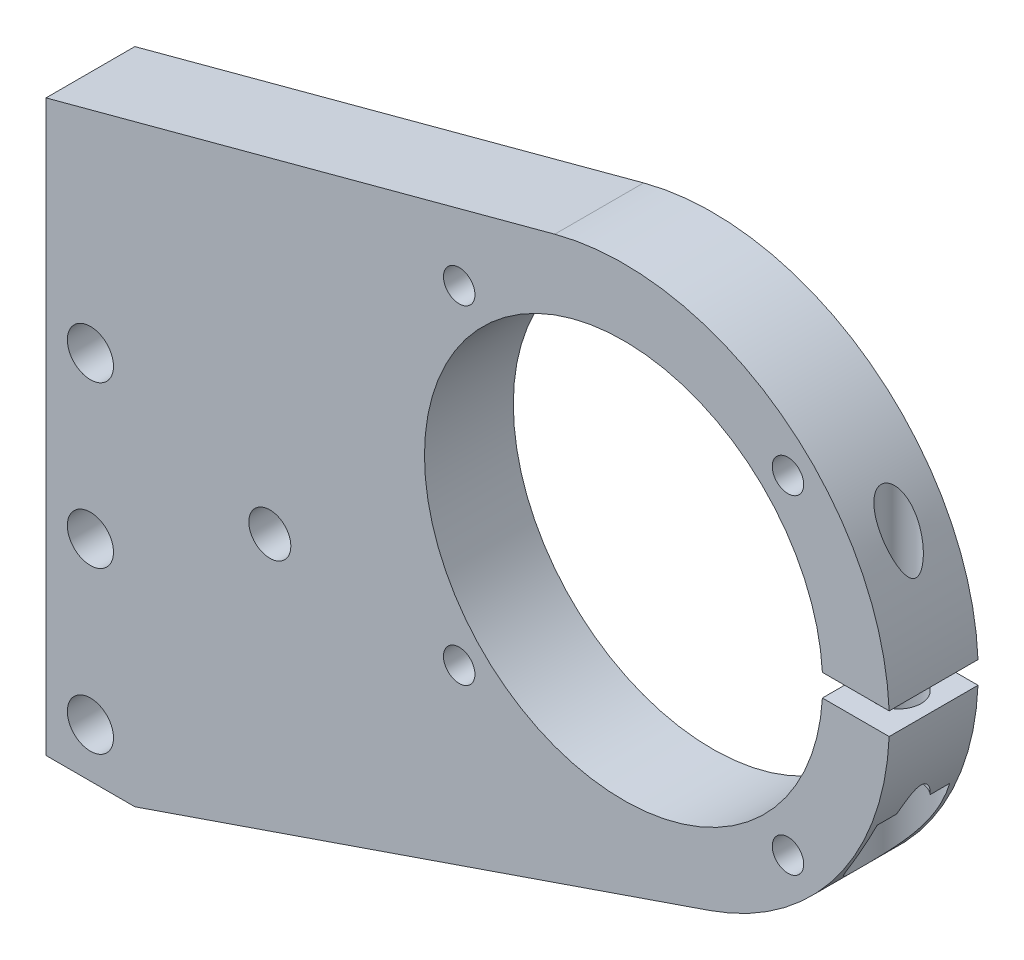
ISO-10303-21;
HEADER;
FILE_DESCRIPTION(('STEP AP214'),'2;1');
FILE_NAME('part.step','',(''),(''),'','','');
FILE_SCHEMA(('AUTOMOTIVE_DESIGN { 1 0 10303 214 1 1 1 1 }'));
ENDSEC;
DATA;
#1=APPLICATION_CONTEXT('core data for automotive mechanical design processes');
#2=APPLICATION_PROTOCOL_DEFINITION('international standard','automotive_design',2000,#1);
#3=PRODUCT_CONTEXT('',#1,'mechanical');
#4=PRODUCT('Part','Part','',(#3));
#5=PRODUCT_RELATED_PRODUCT_CATEGORY('part','',(#4));
#6=PRODUCT_DEFINITION_FORMATION('','',#4);
#7=PRODUCT_DEFINITION_CONTEXT('part definition',#1,'design');
#8=PRODUCT_DEFINITION('design','',#6,#7);
#9=PRODUCT_DEFINITION_SHAPE('','',#8);
#10=(LENGTH_UNIT() NAMED_UNIT(*) SI_UNIT(.MILLI.,.METRE.));
#11=(NAMED_UNIT(*) PLANE_ANGLE_UNIT() SI_UNIT($,.RADIAN.));
#12=(NAMED_UNIT(*) SI_UNIT($,.STERADIAN.) SOLID_ANGLE_UNIT());
#13=UNCERTAINTY_MEASURE_WITH_UNIT(LENGTH_MEASURE(1.E-05),#10,'distance_accuracy_value','');
#14=(GEOMETRIC_REPRESENTATION_CONTEXT(3) GLOBAL_UNCERTAINTY_ASSIGNED_CONTEXT((#13)) GLOBAL_UNIT_ASSIGNED_CONTEXT((#10,
#11,#12)) REPRESENTATION_CONTEXT('',''));
#15=CARTESIAN_POINT('',(0.,0.,0.));
#16=DIRECTION('',(0.,0.,1.));
#17=DIRECTION('',(1.,0.,0.));
#18=AXIS2_PLACEMENT_3D('',#15,#16,#17);
#19=CARTESIAN_POINT('',(-141.600117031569,110.506438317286,12.7));
#20=DIRECTION('',(0.,0.,-1.));
#21=DIRECTION('',(-1.,0.,0.));
#22=AXIS2_PLACEMENT_3D('',#19,#20,#21);
#23=CYLINDRICAL_SURFACE('',#22,38.);
#24=CARTESIAN_POINT('',(-106.511588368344,95.9189383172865,3.95450924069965));
#25=CARTESIAN_POINT('',(-106.453379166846,96.0589408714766,4.00612598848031));
#26=CARTESIAN_POINT('',(-106.396344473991,96.1985077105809,4.0603752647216));
#27=CARTESIAN_POINT('',(-106.284672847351,96.4764072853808,4.17503198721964));
#28=CARTESIAN_POINT('',(-106.230040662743,96.6147371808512,4.23545090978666));
#29=CARTESIAN_POINT('',(-106.123382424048,96.8894249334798,4.36322486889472));
#30=CARTESIAN_POINT('',(-106.071359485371,97.0257803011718,4.43058791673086));
#31=CARTESIAN_POINT('',(-105.970300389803,97.2952001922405,4.5734441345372));
#32=CARTESIAN_POINT('',(-105.921261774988,97.4282673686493,4.648930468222));
#33=CARTESIAN_POINT('',(-105.834418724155,97.6678910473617,4.79681156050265));
#34=CARTESIAN_POINT('',(-105.796094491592,97.7752033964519,4.86766676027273));
#35=CARTESIAN_POINT('',(-105.722207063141,97.9849396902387,5.01857034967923));
#36=CARTESIAN_POINT('',(-105.68665386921,98.0873454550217,5.0986496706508));
#37=CARTESIAN_POINT('',(-105.636021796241,98.2350638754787,5.22815154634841));
#38=CARTESIAN_POINT('',(-105.619486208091,98.2836459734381,5.27323807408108));
#39=CARTESIAN_POINT('',(-105.587651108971,98.3777621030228,5.36687869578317));
#40=CARTESIAN_POINT('',(-105.572352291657,98.4232944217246,5.41543470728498));
#41=CARTESIAN_POINT('',(-105.528905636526,98.5533696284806,5.56657532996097));
#42=CARTESIAN_POINT('',(-105.502923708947,98.6322231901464,5.67531863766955));
#43=CARTESIAN_POINT('',(-105.472632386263,98.7248491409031,5.84683967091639));
#44=CARTESIAN_POINT('',(-105.46423004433,98.7506652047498,5.90235495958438));
#45=CARTESIAN_POINT('',(-105.450154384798,98.7940214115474,6.0168926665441));
#46=CARTESIAN_POINT('',(-105.444478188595,98.8115702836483,6.07591131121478));
#47=CARTESIAN_POINT('',(-105.436377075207,98.83664392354,6.19690920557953));
#48=CARTESIAN_POINT('',(-105.433983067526,98.8440733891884,6.25891098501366));
#49=CARTESIAN_POINT('',(-105.432860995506,98.8475534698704,6.38327478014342));
#50=CARTESIAN_POINT('',(-105.434132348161,98.8436058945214,6.44563673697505));
#51=CARTESIAN_POINT('',(-105.439865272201,98.8258449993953,6.5624005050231));
#52=CARTESIAN_POINT('',(-105.443999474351,98.8130442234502,6.6169803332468));
#53=CARTESIAN_POINT('',(-105.454715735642,98.7799611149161,6.72353567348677));
#54=CARTESIAN_POINT('',(-105.461299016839,98.7596750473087,6.77550987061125));
#55=CARTESIAN_POINT('',(-105.481380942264,98.6980300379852,6.90904632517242));
#56=CARTESIAN_POINT('',(-105.49659636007,98.6515341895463,6.98795664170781));
#57=CARTESIAN_POINT('',(-105.530774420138,98.5479469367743,7.13760712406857));
#58=CARTESIAN_POINT('',(-105.54975012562,98.4908186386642,7.20831740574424));
#59=CARTESIAN_POINT('',(-105.590296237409,98.3698459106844,7.34250668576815));
#60=CARTESIAN_POINT('',(-105.611861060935,98.3060159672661,7.40600068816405));
#61=CARTESIAN_POINT('',(-105.656991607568,98.1736918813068,7.52721039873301));
#62=CARTESIAN_POINT('',(-105.680559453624,98.1051928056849,7.58491983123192));
#63=CARTESIAN_POINT('',(-105.729401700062,97.9646143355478,7.69577415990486));
#64=CARTESIAN_POINT('',(-105.754684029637,97.8925187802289,7.74889484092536));
#65=CARTESIAN_POINT('',(-105.806602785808,97.7459369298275,7.85103555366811));
#66=CARTESIAN_POINT('',(-105.833239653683,97.6714498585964,7.90005423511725));
#67=CARTESIAN_POINT('',(-105.909210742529,97.4611422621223,8.03194914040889));
#68=CARTESIAN_POINT('',(-105.959846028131,97.3233724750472,8.11096728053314));
#69=CARTESIAN_POINT('',(-106.064345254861,97.0442243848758,8.26018101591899));
#70=CARTESIAN_POINT('',(-106.118212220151,96.9028427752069,8.33036815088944));
#71=CARTESIAN_POINT('',(-106.227311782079,96.6216712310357,8.46147556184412));
#72=CARTESIAN_POINT('',(-106.282465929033,96.4819446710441,8.52259779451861));
#73=CARTESIAN_POINT('',(-106.367051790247,96.2713820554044,8.60959836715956));
#74=CARTESIAN_POINT('',(-106.395526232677,96.2011044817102,8.63779174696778));
#75=CARTESIAN_POINT('',(-106.453094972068,96.0602405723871,8.69271732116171));
#76=CARTESIAN_POINT('',(-106.482189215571,95.9896542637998,8.71944964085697));
#77=CARTESIAN_POINT('',(-106.511588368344,95.9189383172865,8.74549075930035));
#78=B_SPLINE_CURVE_WITH_KNOTS('',3,(#24,#25,#26,#27,#28,#29,#30,#31,#32,#33,#34,#35,#36,#37,#38,
#39,#40,#41,#42,#43,#44,#45,#46,#47,#48,#49,#50,#51,#52,#53,#54,#55,#56,#57,#58,#59,#60,#61,#62,
#63,#64,#65,#66,#67,#68,#69,#70,#71,#72,#73,#74,#75,#76,#77),.UNSPECIFIED.,.F.,.F.,(4,2,2,2,2,2,
2,2,2,2,2,2,2,2,2,2,2,2,2,2,2,2,2,2,2,2,4),(0.,0.48053417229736,0.961979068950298,
1.44398575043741,1.92558991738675,2.32784972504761,2.73150001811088,2.93626263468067,
3.14113930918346,3.5475692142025,3.7324153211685,3.9170658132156,4.10344354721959,
4.28979163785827,4.45774124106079,4.62577476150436,4.90269769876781,5.18060008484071,
5.45791365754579,5.73552490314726,6.01452149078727,6.29360955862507,6.79326029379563,
7.29338611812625,7.7797402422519,8.02242330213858,8.26508551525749),.UNSPECIFIED.);
#79=CARTESIAN_POINT('',(-106.511588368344,95.9189383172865,3.95450924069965));
#80=VERTEX_POINT('',#79);
#81=CARTESIAN_POINT('',(-106.511588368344,95.9189383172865,8.74549075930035));
#82=VERTEX_POINT('',#81);
#83=EDGE_CURVE('E182',#80,#82,#78,.T.);
#84=ORIENTED_EDGE('',*,*,#83,.F.);
#85=DIRECTION('',(0.,0.,-1.));
#86=VECTOR('',#85,1.);
#87=CARTESIAN_POINT('',(-106.511588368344,95.9189383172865,12.7));
#88=LINE('',#87,#86);
#89=CARTESIAN_POINT('',(-106.511588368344,95.9189383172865,1.16749327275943));
#90=VERTEX_POINT('',#89);
#91=EDGE_CURVE('E317',#90,#80,#88,.F.);
#92=ORIENTED_EDGE('',*,*,#91,.F.);
#93=CARTESIAN_POINT('',(-106.511588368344,95.9189383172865,11.5325067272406));
#94=CARTESIAN_POINT('',(-106.633692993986,95.6252245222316,11.5824802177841));
#95=CARTESIAN_POINT('',(-106.759707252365,95.3325211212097,11.6290454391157));
#96=CARTESIAN_POINT('',(-107.019560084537,94.7493131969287,11.7141979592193));
#97=CARTESIAN_POINT('',(-107.153401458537,94.4588095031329,11.7527823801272));
#98=CARTESIAN_POINT('',(-107.429777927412,93.8783909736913,11.8210093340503));
#99=CARTESIAN_POINT('',(-107.572366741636,93.5884941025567,11.8505881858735));
#100=CARTESIAN_POINT('',(-107.865263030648,93.0117473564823,11.899069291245));
#101=CARTESIAN_POINT('',(-108.015569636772,92.7248971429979,11.917972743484));
#102=CARTESIAN_POINT('',(-108.325847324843,92.1507605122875,11.943750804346));
#103=CARTESIAN_POINT('',(-108.485923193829,91.8635227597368,11.9504557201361));
#104=CARTESIAN_POINT('',(-108.813510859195,91.2932505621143,11.949496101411));
#105=CARTESIAN_POINT('',(-108.981023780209,91.0102167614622,11.9418293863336));
#106=CARTESIAN_POINT('',(-109.322420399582,90.4500788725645,11.9100726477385));
#107=CARTESIAN_POINT('',(-109.496283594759,90.1729596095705,11.8860317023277));
#108=CARTESIAN_POINT('',(-109.849999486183,89.6249568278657,11.819187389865));
#109=CARTESIAN_POINT('',(-110.029849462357,89.3540705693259,11.7763924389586));
#110=CARTESIAN_POINT('',(-110.328159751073,88.9169237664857,11.6887300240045));
#111=CARTESIAN_POINT('',(-110.445193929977,88.7483943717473,11.6502596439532));
#112=CARTESIAN_POINT('',(-110.680809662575,88.4148538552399,11.5637725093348));
#113=CARTESIAN_POINT('',(-110.799391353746,88.2498430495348,11.5157549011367));
#114=CARTESIAN_POINT('',(-111.037380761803,87.9241493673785,11.4093793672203));
#115=CARTESIAN_POINT('',(-111.156787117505,87.7634608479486,11.3510357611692));
#116=CARTESIAN_POINT('',(-111.395892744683,87.4468594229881,11.2230302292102));
#117=CARTESIAN_POINT('',(-111.515592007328,87.2909463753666,11.1533686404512));
#118=CARTESIAN_POINT('',(-111.755595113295,86.9831954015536,11.0009811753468));
#119=CARTESIAN_POINT('',(-111.87589312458,86.8314134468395,10.9181322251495));
#120=CARTESIAN_POINT('',(-112.114754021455,86.5345869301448,10.7388181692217));
#121=CARTESIAN_POINT('',(-112.233316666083,86.3895432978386,10.6423511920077));
#122=CARTESIAN_POINT('',(-112.467093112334,86.1076600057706,10.4348928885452));
#123=CARTESIAN_POINT('',(-112.582310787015,85.9708106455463,10.3239192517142));
#124=CARTESIAN_POINT('',(-112.807640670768,85.7067720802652,10.0865206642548));
#125=CARTESIAN_POINT('',(-112.917755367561,85.5795781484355,9.96010335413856));
#126=CARTESIAN_POINT('',(-113.16690334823,85.2953490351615,9.6453228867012));
#127=CARTESIAN_POINT('',(-113.303079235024,85.1428227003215,9.45049136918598));
#128=CARTESIAN_POINT('',(-113.555601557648,84.8638839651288,9.03152028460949));
#129=CARTESIAN_POINT('',(-113.671971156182,84.7374410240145,8.80741550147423));
#130=CARTESIAN_POINT('',(-113.861953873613,84.5331657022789,8.36731466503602));
#131=CARTESIAN_POINT('',(-113.939350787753,84.4509021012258,8.15506126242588));
#132=CARTESIAN_POINT('',(-114.036786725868,84.3479781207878,7.82494832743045));
#133=CARTESIAN_POINT('',(-114.066162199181,84.3170750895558,7.71291558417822));
#134=CARTESIAN_POINT('',(-114.118179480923,84.2624954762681,7.48559273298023));
#135=CARTESIAN_POINT('',(-114.140824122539,84.2388158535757,7.37030401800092));
#136=CARTESIAN_POINT('',(-114.179036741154,84.1989275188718,7.1366401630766));
#137=CARTESIAN_POINT('',(-114.19456666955,84.1827589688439,7.01825192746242));
#138=CARTESIAN_POINT('',(-114.218048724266,84.1583335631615,6.77991027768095));
#139=CARTESIAN_POINT('',(-114.226000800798,84.1500767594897,6.6599568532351));
#140=CARTESIAN_POINT('',(-114.234151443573,84.1416139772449,6.41952426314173));
#141=CARTESIAN_POINT('',(-114.234351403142,84.1414065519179,6.29904519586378));
#142=CARTESIAN_POINT('',(-114.226997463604,84.1490417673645,6.05858726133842));
#143=CARTESIAN_POINT('',(-114.219444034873,84.1568839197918,5.93860836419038));
#144=CARTESIAN_POINT('',(-114.197723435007,84.1794740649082,5.7104062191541));
#145=CARTESIAN_POINT('',(-114.184179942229,84.1935711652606,5.60205826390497));
#146=CARTESIAN_POINT('',(-114.150998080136,84.2281881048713,5.38732704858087));
#147=CARTESIAN_POINT('',(-114.131357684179,84.2487100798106,5.28094445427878));
#148=CARTESIAN_POINT('',(-114.063770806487,84.3195339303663,4.96583546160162));
#149=CARTESIAN_POINT('',(-114.007138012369,84.3791148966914,4.76094003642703));
#150=CARTESIAN_POINT('',(-113.870918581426,84.5237176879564,4.35622027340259));
#151=CARTESIAN_POINT('',(-113.790345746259,84.6098401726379,4.1571326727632));
#152=CARTESIAN_POINT('',(-113.611960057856,84.8027341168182,3.77766829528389));
#153=CARTESIAN_POINT('',(-113.514137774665,84.9095168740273,3.5973018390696));
#154=CARTESIAN_POINT('',(-113.250609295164,85.2010801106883,3.16671819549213));
#155=CARTESIAN_POINT('',(-113.076220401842,85.3973831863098,2.9295225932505));
#156=CARTESIAN_POINT('',(-112.801543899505,85.7140584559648,2.60757711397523));
#157=CARTESIAN_POINT('',(-112.707646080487,85.8235085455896,2.50577099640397));
#158=CARTESIAN_POINT('',(-112.516620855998,86.0488833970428,2.31290518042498));
#159=CARTESIAN_POINT('',(-112.419494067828,86.1648069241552,2.2218434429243));
#160=CARTESIAN_POINT('',(-112.174866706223,86.460495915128,2.00774915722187));
#161=CARTESIAN_POINT('',(-112.026034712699,86.6436756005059,1.89095519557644));
#162=CARTESIAN_POINT('',(-111.72625426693,87.0200529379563,1.67801983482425));
#163=CARTESIAN_POINT('',(-111.575304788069,87.2132555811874,1.5818888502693));
#164=CARTESIAN_POINT('',(-111.273188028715,87.6079840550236,1.40820476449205));
#165=CARTESIAN_POINT('',(-111.122020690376,87.8095187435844,1.33067206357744));
#166=CARTESIAN_POINT('',(-110.821085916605,88.2193125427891,1.19238702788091));
#167=CARTESIAN_POINT('',(-110.671318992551,88.4275739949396,1.13164060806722));
#168=CARTESIAN_POINT('',(-110.275082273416,88.990695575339,0.989601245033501));
#169=CARTESIAN_POINT('',(-110.030854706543,89.3505394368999,0.921695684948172));
#170=CARTESIAN_POINT('',(-109.552817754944,90.0818959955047,0.820608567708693));
#171=CARTESIAN_POINT('',(-109.319016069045,90.4534169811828,0.787452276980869));
#172=CARTESIAN_POINT('',(-108.863332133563,91.2062575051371,0.750049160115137));
#173=CARTESIAN_POINT('',(-108.641480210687,91.5875986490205,0.745872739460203));
#174=CARTESIAN_POINT('',(-108.211517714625,92.3571750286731,0.761766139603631));
#175=CARTESIAN_POINT('',(-108.0034026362,92.7454079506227,0.781827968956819));
#176=CARTESIAN_POINT('',(-107.566719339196,93.5950924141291,0.847343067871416));
#177=CARTESIAN_POINT('',(-107.340816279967,94.0576211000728,0.896579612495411));
#178=CARTESIAN_POINT('',(-107.017776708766,94.754399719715,0.986934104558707));
#179=CARTESIAN_POINT('',(-106.913079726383,94.9863209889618,1.01965589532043));
#180=CARTESIAN_POINT('',(-106.70862892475,95.4515854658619,1.09002345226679));
#181=CARTESIAN_POINT('',(-106.608874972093,95.6849286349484,1.12766908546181));
#182=CARTESIAN_POINT('',(-106.511588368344,95.9189383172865,1.16749327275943));
#183=B_SPLINE_CURVE_WITH_KNOTS('',3,(#93,#94,#95,#96,#97,#98,#99,#100,#101,#102,#103,#104,#105,
#106,#107,#108,#109,#110,#111,#112,#113,#114,#115,#116,#117,#118,#119,#120,#121,#122,#123,#124,
#125,#126,#127,#128,#129,#130,#131,#132,#133,#134,#135,#136,#137,#138,#139,#140,#141,#142,#143,
#144,#145,#146,#147,#148,#149,#150,#151,#152,#153,#154,#155,#156,#157,#158,#159,#160,#161,#162,
#163,#164,#165,#166,#167,#168,#169,#170,#171,#172,#173,#174,#175,#176,#177,#178,#179,#180,#181,
#182),.UNSPECIFIED.,.F.,.F.,(4,2,2,2,2,2,2,2,2,2,2,2,2,2,2,2,2,2,2,2,2,2,2,2,2,2,2,2,2,2,2,2,2,
2,2,2,2,2,2,2,2,2,2,2,4),(0.,0.965960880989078,1.93226948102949,2.90526041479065,
3.87814207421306,4.86445685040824,5.85092128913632,6.83444195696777,7.81752170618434,
8.44357405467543,9.06968240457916,9.69492920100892,10.3201573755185,10.951605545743,
11.5831405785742,12.2139125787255,12.8443737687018,13.6886482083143,14.5319284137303,
15.2499125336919,15.6091461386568,15.9682283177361,16.3292090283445,16.6901921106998,
17.0511103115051,17.4120066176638,17.7419100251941,18.0719232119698,18.7313273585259,
19.4229451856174,20.11494228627,21.1701203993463,21.6993636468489,22.2285062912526,
23.0173013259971,23.8064930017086,24.5965464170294,25.3868778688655,26.7052283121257,
28.0245366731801,29.3470491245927,30.6691256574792,32.2192758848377,32.9888580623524,
33.7584194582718),.UNSPECIFIED.);
#184=CARTESIAN_POINT('',(-106.511588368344,95.9189383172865,11.5325067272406));
#185=VERTEX_POINT('',#184);
#186=EDGE_CURVE('E145',#185,#90,#183,.T.);
#187=ORIENTED_EDGE('',*,*,#186,.F.);
#188=EDGE_CURVE('E156',#82,#185,#88,.F.);
#189=ORIENTED_EDGE('',*,*,#188,.F.);
#190=EDGE_LOOP('',(#84,#92,#187,#189));
#191=FACE_BOUND('',#190,.T.);
#192=DIRECTION('',(0.,0.,1.));
#193=VECTOR('',#192,1.);
#194=CARTESIAN_POINT('',(-103.633291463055,108.918938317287,0.));
#195=LINE('',#194,#193);
#196=CARTESIAN_POINT('',(-103.633291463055,108.918938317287,0.));
#197=VERTEX_POINT('',#196);
#198=CARTESIAN_POINT('',(-103.633291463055,108.918938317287,12.7));
#199=VERTEX_POINT('',#198);
#200=EDGE_CURVE('E105',#197,#199,#195,.T.);
#201=ORIENTED_EDGE('',*,*,#200,.T.);
#202=CARTESIAN_POINT('',(-141.600117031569,110.506438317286,12.7));
#203=DIRECTION('',(0.,0.,-1.));
#204=DIRECTION('',(-1.,0.,0.));
#205=AXIS2_PLACEMENT_3D('',#202,#203,#204);
#206=CIRCLE('',#205,38.);
#207=CARTESIAN_POINT('',(-129.246532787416,74.5705376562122,12.7));
#208=VERTEX_POINT('',#207);
#209=EDGE_CURVE('E99',#199,#208,#206,.T.);
#210=ORIENTED_EDGE('',*,*,#209,.T.);
#211=DIRECTION('',(0.,0.,-1.));
#212=VECTOR('',#211,1.);
#213=CARTESIAN_POINT('',(-129.246532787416,74.5705376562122,12.7));
#214=LINE('',#213,#212);
#215=CARTESIAN_POINT('',(-129.246532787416,74.5705376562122,0.));
#216=VERTEX_POINT('',#215);
#217=EDGE_CURVE('E102',#208,#216,#214,.T.);
#218=ORIENTED_EDGE('',*,*,#217,.T.);
#219=CARTESIAN_POINT('',(-141.600117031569,110.506438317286,0.));
#220=DIRECTION('',(0.,0.,-1.));
#221=DIRECTION('',(-1.,0.,0.));
#222=AXIS2_PLACEMENT_3D('',#219,#220,#221);
#223=CIRCLE('',#222,38.);
#224=EDGE_CURVE('E135',#197,#216,#223,.T.);
#225=ORIENTED_EDGE('',*,*,#224,.F.);
#226=EDGE_LOOP('',(#201,#210,#218,#225));
#227=FACE_BOUND('',#226,.T.);
#228=ADVANCED_FACE('F33',(#191,#227),#23,.T.);
#229=CARTESIAN_POINT('',(-224.169455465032,46.3049930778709,12.7));
#230=DIRECTION('',(-1.,0.,0.));
#231=DIRECTION('',(0.,0.,1.));
#232=AXIS2_PLACEMENT_3D('',#229,#230,#231);
#233=PLANE('',#232);
#234=DIRECTION('',(0.,1.,0.));
#235=VECTOR('',#234,1.);
#236=CARTESIAN_POINT('',(-224.169455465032,46.3049930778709,0.));
#237=LINE('',#236,#235);
#238=CARTESIAN_POINT('',(-224.169455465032,46.3049930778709,0.));
#239=VERTEX_POINT('',#238);
#240=CARTESIAN_POINT('',(-224.169455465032,127.722545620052,0.));
#241=VERTEX_POINT('',#240);
#242=EDGE_CURVE('E129',#239,#241,#237,.T.);
#243=ORIENTED_EDGE('',*,*,#242,.F.);
#244=DIRECTION('',(0.,0.,-1.));
#245=VECTOR('',#244,1.);
#246=CARTESIAN_POINT('',(-224.169455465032,46.3049930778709,12.7));
#247=LINE('',#246,#245);
#248=CARTESIAN_POINT('',(-224.169455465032,46.3049930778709,12.7));
#249=VERTEX_POINT('',#248);
#250=EDGE_CURVE('E57',#249,#239,#247,.T.);
#251=ORIENTED_EDGE('',*,*,#250,.F.);
#252=DIRECTION('',(0.,1.,0.));
#253=VECTOR('',#252,1.);
#254=CARTESIAN_POINT('',(-224.169455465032,46.3049930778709,12.7));
#255=LINE('',#254,#253);
#256=CARTESIAN_POINT('',(-224.169455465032,127.722545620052,12.7));
#257=VERTEX_POINT('',#256);
#258=EDGE_CURVE('E143',#249,#257,#255,.T.);
#259=ORIENTED_EDGE('',*,*,#258,.T.);
#260=DIRECTION('',(0.,0.,-1.));
#261=VECTOR('',#260,1.);
#262=CARTESIAN_POINT('',(-224.169455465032,127.722545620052,12.7));
#263=LINE('',#262,#261);
#264=EDGE_CURVE('E87',#257,#241,#263,.T.);
#265=ORIENTED_EDGE('',*,*,#264,.T.);
#266=EDGE_LOOP('',(#243,#251,#259,#265));
#267=FACE_BOUND('',#266,.T.);
#268=ADVANCED_FACE('F259',(#267),#233,.T.);
#269=CARTESIAN_POINT('',(-211.469455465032,46.3049930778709,12.7));
#270=DIRECTION('',(0.,-1.,0.));
#271=DIRECTION('',(0.,0.,-1.));
#272=AXIS2_PLACEMENT_3D('',#269,#270,#271);
#273=PLANE('',#272);
#274=DIRECTION('',(-1.,0.,0.));
#275=VECTOR('',#274,1.);
#276=CARTESIAN_POINT('',(-211.469455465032,46.3049930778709,0.));
#277=LINE('',#276,#275);
#278=CARTESIAN_POINT('',(-211.469455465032,46.3049930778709,0.));
#279=VERTEX_POINT('',#278);
#280=EDGE_CURVE('E140',#279,#239,#277,.T.);
#281=ORIENTED_EDGE('',*,*,#280,.F.);
#282=DIRECTION('',(0.,0.,-1.));
#283=VECTOR('',#282,1.);
#284=CARTESIAN_POINT('',(-211.469455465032,46.3049930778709,12.7));
#285=LINE('',#284,#283);
#286=CARTESIAN_POINT('',(-211.469455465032,46.3049930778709,12.7));
#287=VERTEX_POINT('',#286);
#288=EDGE_CURVE('E119',#287,#279,#285,.T.);
#289=ORIENTED_EDGE('',*,*,#288,.F.);
#290=DIRECTION('',(-1.,0.,0.));
#291=VECTOR('',#290,1.);
#292=CARTESIAN_POINT('',(-211.469455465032,46.3049930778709,12.7));
#293=LINE('',#292,#291);
#294=EDGE_CURVE('E123',#287,#249,#293,.T.);
#295=ORIENTED_EDGE('',*,*,#294,.T.);
#296=ORIENTED_EDGE('',*,*,#250,.T.);
#297=EDGE_LOOP('',(#281,#289,#295,#296));
#298=FACE_BOUND('',#297,.T.);
#299=ADVANCED_FACE('F262',(#298),#273,.T.);
#300=CARTESIAN_POINT('',(-129.246532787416,74.5705376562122,12.7));
#301=DIRECTION('',(0.325094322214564,-0.945681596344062,0.));
#302=DIRECTION('',(0.945681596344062,0.325094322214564,0.));
#303=AXIS2_PLACEMENT_3D('',#300,#301,#302);
#304=PLANE('',#303);
#305=DIRECTION('',(-0.945681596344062,-0.325094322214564,0.));
#306=VECTOR('',#305,1.);
#307=CARTESIAN_POINT('',(-129.246532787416,74.5705376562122,0.));
#308=LINE('',#307,#306);
#309=EDGE_CURVE('E118',#216,#279,#308,.T.);
#310=ORIENTED_EDGE('',*,*,#309,.F.);
#311=ORIENTED_EDGE('',*,*,#217,.F.);
#312=DIRECTION('',(-0.945681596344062,-0.325094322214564,0.));
#313=VECTOR('',#312,1.);
#314=CARTESIAN_POINT('',(-129.246532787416,74.5705376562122,12.7));
#315=LINE('',#314,#313);
#316=EDGE_CURVE('E115',#208,#287,#315,.T.);
#317=ORIENTED_EDGE('',*,*,#316,.T.);
#318=ORIENTED_EDGE('',*,*,#288,.T.);
#319=EDGE_LOOP('',(#310,#311,#317,#318));
#320=FACE_BOUND('',#319,.T.);
#321=ADVANCED_FACE('F114',(#320),#304,.T.);
#322=CARTESIAN_POINT('',(-108.633291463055,129.40586719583,3.85000000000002));
#323=CARTESIAN_POINT('',(-108.738904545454,129.590092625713,3.85000482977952));
#324=CARTESIAN_POINT('',(-108.846061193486,129.77342456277,3.85667357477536));
#325=CARTESIAN_POINT('',(-109.06298990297,130.13754234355,3.88477475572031));
#326=CARTESIAN_POINT('',(-109.172762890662,130.318327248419,3.90621249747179));
#327=CARTESIAN_POINT('',(-109.393411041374,130.675023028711,3.96563427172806));
#328=CARTESIAN_POINT('',(-109.504275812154,130.850956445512,4.00351945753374));
#329=CARTESIAN_POINT('',(-109.726396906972,131.197212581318,4.09839928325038));
#330=CARTESIAN_POINT('',(-109.837652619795,131.367541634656,4.15537147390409));
#331=CARTESIAN_POINT('',(-110.032566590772,131.66094393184,4.27590282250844));
#332=CARTESIAN_POINT('',(-110.116561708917,131.785709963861,4.33476175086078));
#333=CARTESIAN_POINT('',(-110.282252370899,132.028821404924,4.46791506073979));
#334=CARTESIAN_POINT('',(-110.363944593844,132.147157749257,4.54223055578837));
#335=CARTESIAN_POINT('',(-110.523336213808,132.375440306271,4.70950196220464));
#336=CARTESIAN_POINT('',(-110.600988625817,132.485292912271,4.80263344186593));
#337=CARTESIAN_POINT('',(-110.74743224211,132.690387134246,5.00970323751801));
#338=CARTESIAN_POINT('',(-110.816248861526,132.785670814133,5.12357948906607));
#339=CARTESIAN_POINT('',(-110.915573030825,132.922124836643,5.32598296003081));
#340=CARTESIAN_POINT('',(-110.950689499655,132.97008435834,5.40764930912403));
#341=CARTESIAN_POINT('',(-111.013256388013,133.055201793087,5.57923037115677));
#342=CARTESIAN_POINT('',(-111.040711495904,133.092366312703,5.66913999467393));
#343=CARTESIAN_POINT('',(-111.086074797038,133.153617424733,5.85679704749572));
#344=CARTESIAN_POINT('',(-111.103881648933,133.177565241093,5.95461572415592));
#345=CARTESIAN_POINT('',(-111.127630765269,133.209477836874,6.15421994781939));
#346=CARTESIAN_POINT('',(-111.133586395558,133.217460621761,6.25600089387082));
#347=CARTESIAN_POINT('',(-111.133014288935,133.216692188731,6.4456510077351));
#348=CARTESIAN_POINT('',(-111.128063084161,133.210054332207,6.533543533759));
#349=CARTESIAN_POINT('',(-111.10925905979,133.184794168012,6.70659684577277));
#350=CARTESIAN_POINT('',(-111.095404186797,133.166169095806,6.79175699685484));
#351=CARTESIAN_POINT('',(-111.06016564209,133.118652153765,6.95600646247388));
#352=CARTESIAN_POINT('',(-111.038898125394,133.089918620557,7.03516772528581));
#353=CARTESIAN_POINT('',(-110.990135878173,133.023781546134,7.18767820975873));
#354=CARTESIAN_POINT('',(-110.962638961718,132.986374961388,7.26102537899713));
#355=CARTESIAN_POINT('',(-110.884620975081,132.879745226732,7.44384963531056));
#356=CARTESIAN_POINT('',(-110.830219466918,132.804944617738,7.54841757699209));
#357=CARTESIAN_POINT('',(-110.713131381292,132.642476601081,7.74180567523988));
#358=CARTESIAN_POINT('',(-110.650421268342,132.554772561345,7.83057935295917));
#359=CARTESIAN_POINT('',(-110.53320769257,132.38920015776,7.9770262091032));
#360=CARTESIAN_POINT('',(-110.47963603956,132.312969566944,8.03735059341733));
#361=CARTESIAN_POINT('',(-110.370282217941,132.156070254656,8.14972667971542));
#362=CARTESIAN_POINT('',(-110.314498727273,132.075398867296,8.20177333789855));
#363=CARTESIAN_POINT('',(-110.201490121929,131.910555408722,8.29840575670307));
#364=CARTESIAN_POINT('',(-110.144263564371,131.826379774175,8.34298367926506));
#365=CARTESIAN_POINT('',(-110.028983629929,131.655296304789,8.42534556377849));
#366=CARTESIAN_POINT('',(-109.970929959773,131.568387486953,8.46312704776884));
#367=CARTESIAN_POINT('',(-109.81174768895,131.327892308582,8.55795579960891));
#368=CARTESIAN_POINT('',(-109.710229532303,131.172116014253,8.60883152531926));
#369=CARTESIAN_POINT('',(-109.507574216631,130.855984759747,8.69472550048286));
#370=CARTESIAN_POINT('',(-109.406437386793,130.6956265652,8.72973223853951));
#371=CARTESIAN_POINT('',(-109.205318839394,130.371320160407,8.78592024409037));
#372=CARTESIAN_POINT('',(-109.105340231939,130.207364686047,8.80707023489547));
#373=CARTESIAN_POINT('',(-108.907393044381,129.877109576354,8.83694227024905));
#374=CARTESIAN_POINT('',(-108.809425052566,129.710809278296,8.8456607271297));
#375=CARTESIAN_POINT('',(-108.564304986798,129.28735310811,8.85346049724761));
#376=CARTESIAN_POINT('',(-108.418812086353,129.029082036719,8.84491379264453));
#377=CARTESIAN_POINT('',(-108.134595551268,128.510504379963,8.80396295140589));
#378=CARTESIAN_POINT('',(-107.995877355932,128.250196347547,8.77153997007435));
#379=CARTESIAN_POINT('',(-107.793576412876,127.859804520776,8.70581917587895));
#380=CARTESIAN_POINT('',(-107.727119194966,127.729713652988,8.68107169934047));
#381=CARTESIAN_POINT('',(-107.596189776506,127.469754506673,8.62584552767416));
#382=CARTESIAN_POINT('',(-107.531717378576,127.339886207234,8.5953674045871));
#383=CARTESIAN_POINT('',(-107.404897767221,127.080748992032,8.52857316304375));
#384=CARTESIAN_POINT('',(-107.342548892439,126.951479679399,8.49226174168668));
#385=CARTESIAN_POINT('',(-107.220038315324,126.693795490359,8.41349706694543));
#386=CARTESIAN_POINT('',(-107.159876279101,126.565380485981,8.37104475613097));
#387=CARTESIAN_POINT('',(-107.043243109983,126.312809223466,8.28056176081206));
#388=CARTESIAN_POINT('',(-106.986718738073,126.188623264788,8.23268327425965));
#389=CARTESIAN_POINT('',(-106.876059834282,125.942049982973,8.12984535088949));
#390=CARTESIAN_POINT('',(-106.821926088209,125.819663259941,8.07488360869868));
#391=CARTESIAN_POINT('',(-106.716389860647,125.577702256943,7.9567864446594));
#392=CARTESIAN_POINT('',(-106.664986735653,125.458127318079,7.89365296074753));
#393=CARTESIAN_POINT('',(-106.565438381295,125.223349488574,7.7575213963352));
#394=CARTESIAN_POINT('',(-106.517289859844,125.108142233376,7.68453351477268));
#395=CARTESIAN_POINT('',(-106.448042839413,124.940267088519,7.56524037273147));
#396=CARTESIAN_POINT('',(-106.425365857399,124.884905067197,7.52364131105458));
#397=CARTESIAN_POINT('',(-106.381311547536,124.776657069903,7.43672209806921));
#398=CARTESIAN_POINT('',(-106.359933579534,124.723769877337,7.39140380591));
#399=CARTESIAN_POINT('',(-106.318884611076,124.621595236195,7.29666429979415));
#400=CARTESIAN_POINT('',(-106.299205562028,124.572291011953,7.24726488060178));
#401=CARTESIAN_POINT('',(-106.261929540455,124.478376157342,7.14352215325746));
#402=CARTESIAN_POINT('',(-106.244329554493,124.433758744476,7.0891862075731));
#403=CARTESIAN_POINT('',(-106.214474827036,124.357709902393,6.98389617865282));
#404=CARTESIAN_POINT('',(-106.201814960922,124.325309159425,6.93376782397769));
#405=CARTESIAN_POINT('',(-106.179078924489,124.266926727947,6.82926679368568));
#406=CARTESIAN_POINT('',(-106.169002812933,124.240945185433,6.77489402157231));
#407=CARTESIAN_POINT('',(-106.152107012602,124.197280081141,6.66151353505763));
#408=CARTESIAN_POINT('',(-106.145330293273,124.179706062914,6.60245573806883));
#409=CARTESIAN_POINT('',(-106.136041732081,124.155597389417,6.48182587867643));
#410=CARTESIAN_POINT('',(-106.133521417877,124.149040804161,6.42025906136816));
#411=CARTESIAN_POINT('',(-106.133115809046,124.14798583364,6.30402498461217));
#412=CARTESIAN_POINT('',(-106.134736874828,124.15220322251,6.24936780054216));
#413=CARTESIAN_POINT('',(-106.141400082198,124.16950805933,6.14168390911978));
#414=CARTESIAN_POINT('',(-106.146445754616,124.182604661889,6.08865894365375));
#415=CARTESIAN_POINT('',(-106.161243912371,124.220912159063,5.9713550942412));
#416=CARTESIAN_POINT('',(-106.17190661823,124.248457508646,5.90796770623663));
#417=CARTESIAN_POINT('',(-106.196799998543,124.312462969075,5.78664293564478));
#418=CARTESIAN_POINT('',(-106.211038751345,124.348943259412,5.72871830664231));
#419=CARTESIAN_POINT('',(-106.240006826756,124.422758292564,5.62567347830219));
#420=CARTESIAN_POINT('',(-106.254407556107,124.459305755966,5.57988225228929));
#421=CARTESIAN_POINT('',(-106.284734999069,124.535889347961,5.4918341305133));
#422=CARTESIAN_POINT('',(-106.300662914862,124.575928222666,5.44958006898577));
#423=CARTESIAN_POINT('',(-106.350309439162,124.700062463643,5.32737154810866));
#424=CARTESIAN_POINT('',(-106.385843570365,124.788054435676,5.25212789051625));
#425=CARTESIAN_POINT('',(-106.464271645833,124.98001137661,5.1037549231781));
#426=CARTESIAN_POINT('',(-106.50754540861,125.084670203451,5.03176011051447));
#427=CARTESIAN_POINT('',(-106.597210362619,125.298666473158,4.89710389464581));
#428=CARTESIAN_POINT('',(-106.643605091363,125.408009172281,4.83445335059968));
#429=CARTESIAN_POINT('',(-106.739043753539,125.629936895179,4.71672844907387));
#430=CARTESIAN_POINT('',(-106.788094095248,125.742529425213,4.66167366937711));
#431=CARTESIAN_POINT('',(-106.888396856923,125.96968179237,4.55820569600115));
#432=CARTESIAN_POINT('',(-106.939648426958,126.084240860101,4.50978996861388));
#433=CARTESIAN_POINT('',(-107.051286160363,126.330437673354,4.4126159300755));
#434=CARTESIAN_POINT('',(-107.111965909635,126.462276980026,4.3647085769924));
#435=CARTESIAN_POINT('',(-107.235742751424,126.72713995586,4.27571348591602));
#436=CARTESIAN_POINT('',(-107.29884037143,126.860163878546,4.23462724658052));
#437=CARTESIAN_POINT('',(-107.427369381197,127.12706634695,4.15880751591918));
#438=CARTESIAN_POINT('',(-107.492803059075,127.26094561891,4.12408046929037));
#439=CARTESIAN_POINT('',(-107.625837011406,127.529091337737,4.06079589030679));
#440=CARTESIAN_POINT('',(-107.693437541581,127.663357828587,4.03223908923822));
#441=CARTESIAN_POINT('',(-107.899558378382,128.066721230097,3.95559104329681));
#442=CARTESIAN_POINT('',(-108.041218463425,128.336008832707,3.91662698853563));
#443=CARTESIAN_POINT('',(-108.331951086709,128.872771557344,3.86383923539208));
#444=CARTESIAN_POINT('',(-108.481016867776,129.140248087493,3.84999303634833));
#445=CARTESIAN_POINT('',(-108.633291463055,129.40586719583,3.85000000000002));
#446=B_SPLINE_CURVE_WITH_KNOTS('',3,(#322,#323,#324,#325,#326,#327,#328,#329,#330,#331,#332,
#333,#334,#335,#336,#337,#338,#339,#340,#341,#342,#343,#344,#345,#346,#347,#348,#349,#350,#351,
#352,#353,#354,#355,#356,#357,#358,#359,#360,#361,#362,#363,#364,#365,#366,#367,#368,#369,#370,
#371,#372,#373,#374,#375,#376,#377,#378,#379,#380,#381,#382,#383,#384,#385,#386,#387,#388,#389,
#390,#391,#392,#393,#394,#395,#396,#397,#398,#399,#400,#401,#402,#403,#404,#405,#406,#407,#408,
#409,#410,#411,#412,#413,#414,#415,#416,#417,#418,#419,#420,#421,#422,#423,#424,#425,#426,#427,
#428,#429,#430,#431,#432,#433,#434,#435,#436,#437,#438,#439,#440,#441,#442,#443,#444,#445),
.UNSPECIFIED.,.T.,.F.,(4,2,2,2,2,2,2,2,2,2,2,2,2,2,2,2,2,2,2,2,2,2,2,2,2,2,2,2,2,2,2,2,2,2,2,2,
2,2,2,2,2,2,2,2,2,2,2,2,2,2,2,2,2,2,2,2,2,2,2,2,2,4),(0.,0.636906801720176,1.27404253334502,
1.90740106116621,2.54001726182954,3.02385486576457,3.50835777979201,3.99760965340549,
4.48542112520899,4.78746809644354,5.08932982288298,5.39430357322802,5.69893317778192,
5.96244285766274,6.2260133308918,6.48562674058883,6.74533139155,7.16176588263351,
7.5794062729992,7.91193887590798,8.24467332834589,8.5777548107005,8.91095748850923,
9.48834039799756,10.0661414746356,10.6452422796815,11.2245101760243,12.1129745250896,
13.0021408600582,13.4465324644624,13.8908797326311,14.3348709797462,14.7787941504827,
15.2124224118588,15.6461921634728,16.0798592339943,16.5130808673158,16.7315706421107,
16.9499518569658,17.1672341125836,17.3841974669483,17.5668237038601,17.7494540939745,
17.9344032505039,18.1189838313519,18.282613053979,18.4464112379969,18.6550364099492,
18.8641371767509,19.0448714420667,19.225749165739,19.5881100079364,19.9901646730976,
20.3926829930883,20.7962201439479,21.1996028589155,21.6579101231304,22.1163179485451,
22.5751878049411,23.0341120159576,23.9532379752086,24.8715401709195),.UNSPECIFIED.);
#447=CARTESIAN_POINT('',(-108.633291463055,129.40586719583,3.85000000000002));
#448=VERTEX_POINT('',#447);
#449=EDGE_CURVE('E284',#448,#448,#446,.T.);
#450=ORIENTED_EDGE('',*,*,#449,.F.);
#451=EDGE_LOOP('',(#450));
#452=FACE_BOUND('',#451,.T.);
#453=DIRECTION('',(0.,0.,1.));
#454=VECTOR('',#453,1.);
#455=CARTESIAN_POINT('',(-103.633291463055,112.093938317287,0.));
#456=LINE('',#455,#454);
#457=CARTESIAN_POINT('',(-103.633291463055,112.093938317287,0.));
#458=VERTEX_POINT('',#457);
#459=CARTESIAN_POINT('',(-103.633291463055,112.093938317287,12.7));
#460=VERTEX_POINT('',#459);
#461=EDGE_CURVE('E242',#458,#460,#456,.T.);
#462=ORIENTED_EDGE('',*,*,#461,.F.);
#463=CARTESIAN_POINT('',(-151.435240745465,147.211619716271,0.));
#464=VERTEX_POINT('',#463);
#465=EDGE_CURVE('E136',#464,#458,#223,.T.);
#466=ORIENTED_EDGE('',*,*,#465,.F.);
#467=DIRECTION('',(0.,0.,-1.));
#468=VECTOR('',#467,1.);
#469=CARTESIAN_POINT('',(-151.435240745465,147.211619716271,12.7));
#470=LINE('',#469,#468);
#471=CARTESIAN_POINT('',(-151.435240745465,147.211619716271,12.7));
#472=VERTEX_POINT('',#471);
#473=EDGE_CURVE('E120',#472,#464,#470,.T.);
#474=ORIENTED_EDGE('',*,*,#473,.F.);
#475=EDGE_CURVE('E109',#472,#460,#206,.T.);
#476=ORIENTED_EDGE('',*,*,#475,.T.);
#477=EDGE_LOOP('',(#462,#466,#474,#476));
#478=FACE_BOUND('',#477,.T.);
#479=ADVANCED_FACE('F158',(#452,#478),#23,.T.);
#480=CARTESIAN_POINT('',(-224.169455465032,127.722545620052,12.7));
#481=DIRECTION('',(-0.258819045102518,0.965925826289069,0.));
#482=DIRECTION('',(-0.965925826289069,-0.258819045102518,0.));
#483=AXIS2_PLACEMENT_3D('',#480,#481,#482);
#484=PLANE('',#483);
#485=DIRECTION('',(0.965925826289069,0.258819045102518,0.));
#486=VECTOR('',#485,1.);
#487=CARTESIAN_POINT('',(-224.169455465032,127.722545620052,0.));
#488=LINE('',#487,#486);
#489=EDGE_CURVE('E132',#241,#464,#488,.T.);
#490=ORIENTED_EDGE('',*,*,#489,.F.);
#491=ORIENTED_EDGE('',*,*,#264,.F.);
#492=DIRECTION('',(0.965925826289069,0.258819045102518,0.));
#493=VECTOR('',#492,1.);
#494=CARTESIAN_POINT('',(-224.169455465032,127.722545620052,12.7));
#495=LINE('',#494,#493);
#496=EDGE_CURVE('E110',#257,#472,#495,.T.);
#497=ORIENTED_EDGE('',*,*,#496,.T.);
#498=ORIENTED_EDGE('',*,*,#473,.T.);
#499=EDGE_LOOP('',(#490,#491,#497,#498));
#500=FACE_BOUND('',#499,.T.);
#501=ADVANCED_FACE('F255',(#500),#484,.T.);
#502=CARTESIAN_POINT('',(-141.600117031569,110.506438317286,12.7));
#503=DIRECTION('',(0.,0.,-1.));
#504=DIRECTION('',(-1.,0.,0.));
#505=AXIS2_PLACEMENT_3D('',#502,#503,#504);
#506=PLANE('',#505);
#507=CARTESIAN_POINT('',(-192.169455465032,89.7225456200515,12.7));
#508=DIRECTION('',(0.,0.,1.));
#509=DIRECTION('',(1.,0.,0.));
#510=AXIS2_PLACEMENT_3D('',#507,#508,#509);
#511=CIRCLE('',#510,3.);
#512=CARTESIAN_POINT('',(-189.169455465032,89.7225456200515,12.7));
#513=VERTEX_POINT('',#512);
#514=EDGE_CURVE('E189',#513,#513,#511,.T.);
#515=ORIENTED_EDGE('',*,*,#514,.F.);
#516=EDGE_LOOP('',(#515));
#517=FACE_BOUND('',#516,.T.);
#518=CARTESIAN_POINT('',(-217.819455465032,53.3049930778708,12.7));
#519=DIRECTION('',(0.,0.,-1.));
#520=DIRECTION('',(-1.,0.,0.));
#521=AXIS2_PLACEMENT_3D('',#518,#519,#520);
#522=CIRCLE('',#521,3.29999999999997);
#523=CARTESIAN_POINT('',(-221.119455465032,53.3049930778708,12.7));
#524=VERTEX_POINT('',#523);
#525=EDGE_CURVE('E197',#524,#524,#522,.T.);
#526=ORIENTED_EDGE('',*,*,#525,.T.);
#527=EDGE_LOOP('',(#526));
#528=FACE_BOUND('',#527,.T.);
#529=CARTESIAN_POINT('',(-217.819455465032,76.3049930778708,12.7));
#530=DIRECTION('',(0.,0.,-1.));
#531=DIRECTION('',(-1.,0.,0.));
#532=AXIS2_PLACEMENT_3D('',#529,#530,#531);
#533=CIRCLE('',#532,3.3);
#534=CARTESIAN_POINT('',(-221.119455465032,76.3049930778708,12.7));
#535=VERTEX_POINT('',#534);
#536=EDGE_CURVE('E200',#535,#535,#533,.T.);
#537=ORIENTED_EDGE('',*,*,#536,.T.);
#538=EDGE_LOOP('',(#537));
#539=FACE_BOUND('',#538,.T.);
#540=CARTESIAN_POINT('',(-217.819455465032,99.3049930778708,12.7));
#541=DIRECTION('',(0.,0.,-1.));
#542=DIRECTION('',(-1.,0.,0.));
#543=AXIS2_PLACEMENT_3D('',#540,#541,#542);
#544=CIRCLE('',#543,3.3);
#545=CARTESIAN_POINT('',(-221.119455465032,99.3049930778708,12.7));
#546=VERTEX_POINT('',#545);
#547=EDGE_CURVE('E203',#546,#546,#544,.T.);
#548=ORIENTED_EDGE('',*,*,#547,.T.);
#549=EDGE_LOOP('',(#548));
#550=FACE_BOUND('',#549,.T.);
#551=CARTESIAN_POINT('',(-118.100117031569,87.0064383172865,12.7));
#552=DIRECTION('',(0.,0.,1.));
#553=DIRECTION('',(1.,0.,0.));
#554=AXIS2_PLACEMENT_3D('',#551,#552,#553);
#555=CIRCLE('',#554,2.24999999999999);
#556=CARTESIAN_POINT('',(-115.850117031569,87.0064383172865,12.7));
#557=VERTEX_POINT('',#556);
#558=EDGE_CURVE('E206',#557,#557,#555,.T.);
#559=ORIENTED_EDGE('',*,*,#558,.F.);
#560=EDGE_LOOP('',(#559));
#561=FACE_BOUND('',#560,.T.);
#562=CARTESIAN_POINT('',(-165.100117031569,87.0064383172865,12.7));
#563=DIRECTION('',(0.,0.,1.));
#564=DIRECTION('',(1.,0.,0.));
#565=AXIS2_PLACEMENT_3D('',#562,#563,#564);
#566=CIRCLE('',#565,2.25);
#567=CARTESIAN_POINT('',(-162.850117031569,87.0064383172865,12.7));
#568=VERTEX_POINT('',#567);
#569=EDGE_CURVE('E212',#568,#568,#566,.T.);
#570=ORIENTED_EDGE('',*,*,#569,.F.);
#571=EDGE_LOOP('',(#570));
#572=FACE_BOUND('',#571,.T.);
#573=CARTESIAN_POINT('',(-165.100117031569,134.006438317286,12.7));
#574=DIRECTION('',(0.,0.,1.));
#575=DIRECTION('',(1.,0.,0.));
#576=AXIS2_PLACEMENT_3D('',#573,#574,#575);
#577=CIRCLE('',#576,2.25);
#578=CARTESIAN_POINT('',(-162.850117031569,134.006438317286,12.7));
#579=VERTEX_POINT('',#578);
#580=EDGE_CURVE('E218',#579,#579,#577,.T.);
#581=ORIENTED_EDGE('',*,*,#580,.F.);
#582=EDGE_LOOP('',(#581));
#583=FACE_BOUND('',#582,.T.);
#584=CARTESIAN_POINT('',(-118.100117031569,134.006438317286,12.7));
#585=DIRECTION('',(0.,0.,1.));
#586=DIRECTION('',(1.,0.,0.));
#587=AXIS2_PLACEMENT_3D('',#584,#585,#586);
#588=CIRCLE('',#587,2.24999999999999);
#589=CARTESIAN_POINT('',(-115.850117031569,134.006438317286,12.7));
#590=VERTEX_POINT('',#589);
#591=EDGE_CURVE('E224',#590,#590,#588,.T.);
#592=ORIENTED_EDGE('',*,*,#591,.F.);
#593=EDGE_LOOP('',(#592));
#594=FACE_BOUND('',#593,.T.);
#595=DIRECTION('',(1.,0.,0.));
#596=VECTOR('',#595,1.);
#597=CARTESIAN_POINT('',(-113.179018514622,108.918938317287,12.7));
#598=LINE('',#597,#596);
#599=CARTESIAN_POINT('',(-113.179018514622,108.918938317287,12.7));
#600=VERTEX_POINT('',#599);
#601=EDGE_CURVE('E239',#600,#199,#598,.T.);
#602=ORIENTED_EDGE('',*,*,#601,.F.);
#603=CARTESIAN_POINT('',(-141.600117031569,110.506438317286,12.7));
#604=DIRECTION('',(0.,0.,1.));
#605=DIRECTION('',(1.,0.,0.));
#606=AXIS2_PLACEMENT_3D('',#603,#604,#605);
#607=CIRCLE('',#606,28.4654);
#608=CARTESIAN_POINT('',(-113.179018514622,112.093938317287,12.7));
#609=VERTEX_POINT('',#608);
#610=EDGE_CURVE('E230',#609,#600,#607,.T.);
#611=ORIENTED_EDGE('',*,*,#610,.F.);
#612=DIRECTION('',(-1.,0.,0.));
#613=VECTOR('',#612,1.);
#614=CARTESIAN_POINT('',(-103.633291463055,112.093938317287,12.7));
#615=LINE('',#614,#613);
#616=EDGE_CURVE('E234',#460,#609,#615,.T.);
#617=ORIENTED_EDGE('',*,*,#616,.F.);
#618=ORIENTED_EDGE('',*,*,#475,.F.);
#619=ORIENTED_EDGE('',*,*,#496,.F.);
#620=ORIENTED_EDGE('',*,*,#258,.F.);
#621=ORIENTED_EDGE('',*,*,#294,.F.);
#622=ORIENTED_EDGE('',*,*,#316,.F.);
#623=ORIENTED_EDGE('',*,*,#209,.F.);
#624=EDGE_LOOP('',(#602,#611,#617,#618,#619,#620,#621,#622,#623));
#625=FACE_BOUND('',#624,.T.);
#626=ADVANCED_FACE('F122',(#517,#528,#539,#550,#561,#572,#583,#594,#625),#506,.F.);
#627=CARTESIAN_POINT('',(-141.600117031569,110.506438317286,0.));
#628=DIRECTION('',(0.,0.,-1.));
#629=DIRECTION('',(-1.,0.,0.));
#630=AXIS2_PLACEMENT_3D('',#627,#628,#629);
#631=PLANE('',#630);
#632=CARTESIAN_POINT('',(-217.819455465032,53.3049930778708,0.));
#633=DIRECTION('',(0.,0.,-1.));
#634=DIRECTION('',(-1.,0.,0.));
#635=AXIS2_PLACEMENT_3D('',#632,#633,#634);
#636=CIRCLE('',#635,6.30000000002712);
#637=CARTESIAN_POINT('',(-224.119455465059,53.3049930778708,0.));
#638=VERTEX_POINT('',#637);
#639=EDGE_CURVE('E353',#638,#638,#636,.F.);
#640=ORIENTED_EDGE('',*,*,#639,.T.);
#641=EDGE_LOOP('',(#640));
#642=FACE_BOUND('',#641,.T.);
#643=CARTESIAN_POINT('',(-217.819455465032,76.3049930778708,0.));
#644=DIRECTION('',(0.,0.,-1.));
#645=DIRECTION('',(-1.,0.,0.));
#646=AXIS2_PLACEMENT_3D('',#643,#644,#645);
#647=CIRCLE('',#646,6.30000000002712);
#648=CARTESIAN_POINT('',(-224.119455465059,76.3049930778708,0.));
#649=VERTEX_POINT('',#648);
#650=EDGE_CURVE('E357',#649,#649,#647,.F.);
#651=ORIENTED_EDGE('',*,*,#650,.T.);
#652=EDGE_LOOP('',(#651));
#653=FACE_BOUND('',#652,.T.);
#654=CARTESIAN_POINT('',(-217.819455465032,99.3049930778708,0.));
#655=DIRECTION('',(0.,0.,-1.));
#656=DIRECTION('',(-1.,0.,0.));
#657=AXIS2_PLACEMENT_3D('',#654,#655,#656);
#658=CIRCLE('',#657,6.30000000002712);
#659=CARTESIAN_POINT('',(-224.119455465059,99.3049930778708,0.));
#660=VERTEX_POINT('',#659);
#661=EDGE_CURVE('E361',#660,#660,#658,.F.);
#662=ORIENTED_EDGE('',*,*,#661,.T.);
#663=EDGE_LOOP('',(#662));
#664=FACE_BOUND('',#663,.T.);
#665=CARTESIAN_POINT('',(-192.169455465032,89.7225456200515,0.));
#666=DIRECTION('',(0.,0.,1.));
#667=DIRECTION('',(1.,0.,0.));
#668=AXIS2_PLACEMENT_3D('',#665,#666,#667);
#669=CIRCLE('',#668,2.99999999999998);
#670=CARTESIAN_POINT('',(-189.169455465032,89.7225456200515,0.));
#671=VERTEX_POINT('',#670);
#672=EDGE_CURVE('E194',#671,#671,#669,.T.);
#673=ORIENTED_EDGE('',*,*,#672,.T.);
#674=EDGE_LOOP('',(#673));
#675=FACE_BOUND('',#674,.T.);
#676=CARTESIAN_POINT('',(-118.100117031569,87.0064383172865,0.));
#677=DIRECTION('',(0.,0.,1.));
#678=DIRECTION('',(1.,0.,0.));
#679=AXIS2_PLACEMENT_3D('',#676,#677,#678);
#680=CIRCLE('',#679,2.24999999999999);
#681=CARTESIAN_POINT('',(-115.850117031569,87.0064383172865,0.));
#682=VERTEX_POINT('',#681);
#683=EDGE_CURVE('E209',#682,#682,#680,.T.);
#684=ORIENTED_EDGE('',*,*,#683,.T.);
#685=EDGE_LOOP('',(#684));
#686=FACE_BOUND('',#685,.T.);
#687=CARTESIAN_POINT('',(-165.100117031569,87.0064383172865,0.));
#688=DIRECTION('',(0.,0.,1.));
#689=DIRECTION('',(1.,0.,0.));
#690=AXIS2_PLACEMENT_3D('',#687,#688,#689);
#691=CIRCLE('',#690,2.24999999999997);
#692=CARTESIAN_POINT('',(-162.850117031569,87.0064383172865,0.));
#693=VERTEX_POINT('',#692);
#694=EDGE_CURVE('E215',#693,#693,#691,.T.);
#695=ORIENTED_EDGE('',*,*,#694,.T.);
#696=EDGE_LOOP('',(#695));
#697=FACE_BOUND('',#696,.T.);
#698=CARTESIAN_POINT('',(-165.100117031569,134.006438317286,0.));
#699=DIRECTION('',(0.,0.,1.));
#700=DIRECTION('',(1.,0.,0.));
#701=AXIS2_PLACEMENT_3D('',#698,#699,#700);
#702=CIRCLE('',#701,2.24999999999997);
#703=CARTESIAN_POINT('',(-162.850117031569,134.006438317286,0.));
#704=VERTEX_POINT('',#703);
#705=EDGE_CURVE('E221',#704,#704,#702,.T.);
#706=ORIENTED_EDGE('',*,*,#705,.T.);
#707=EDGE_LOOP('',(#706));
#708=FACE_BOUND('',#707,.T.);
#709=CARTESIAN_POINT('',(-118.100117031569,134.006438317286,0.));
#710=DIRECTION('',(0.,0.,1.));
#711=DIRECTION('',(1.,0.,0.));
#712=AXIS2_PLACEMENT_3D('',#709,#710,#711);
#713=CIRCLE('',#712,2.24999999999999);
#714=CARTESIAN_POINT('',(-115.850117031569,134.006438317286,0.));
#715=VERTEX_POINT('',#714);
#716=EDGE_CURVE('E227',#715,#715,#713,.T.);
#717=ORIENTED_EDGE('',*,*,#716,.T.);
#718=EDGE_LOOP('',(#717));
#719=FACE_BOUND('',#718,.T.);
#720=CARTESIAN_POINT('',(-141.600117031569,110.506438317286,0.));
#721=DIRECTION('',(0.,0.,1.));
#722=DIRECTION('',(1.,0.,0.));
#723=AXIS2_PLACEMENT_3D('',#720,#721,#722);
#724=CIRCLE('',#723,28.4654);
#725=CARTESIAN_POINT('',(-113.179018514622,112.093938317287,0.));
#726=VERTEX_POINT('',#725);
#727=CARTESIAN_POINT('',(-113.179018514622,108.918938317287,0.));
#728=VERTEX_POINT('',#727);
#729=EDGE_CURVE('E48',#726,#728,#724,.T.);
#730=ORIENTED_EDGE('',*,*,#729,.T.);
#731=DIRECTION('',(1.,0.,0.));
#732=VECTOR('',#731,1.);
#733=CARTESIAN_POINT('',(-113.179018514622,108.918938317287,0.));
#734=LINE('',#733,#732);
#735=EDGE_CURVE('E238',#728,#197,#734,.T.);
#736=ORIENTED_EDGE('',*,*,#735,.T.);
#737=ORIENTED_EDGE('',*,*,#224,.T.);
#738=ORIENTED_EDGE('',*,*,#309,.T.);
#739=ORIENTED_EDGE('',*,*,#280,.T.);
#740=ORIENTED_EDGE('',*,*,#242,.T.);
#741=ORIENTED_EDGE('',*,*,#489,.T.);
#742=ORIENTED_EDGE('',*,*,#465,.T.);
#743=DIRECTION('',(-1.,0.,0.));
#744=VECTOR('',#743,1.);
#745=CARTESIAN_POINT('',(-103.633291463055,112.093938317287,0.));
#746=LINE('',#745,#744);
#747=EDGE_CURVE('E235',#458,#726,#746,.T.);
#748=ORIENTED_EDGE('',*,*,#747,.T.);
#749=EDGE_LOOP('',(#730,#736,#737,#738,#739,#740,#741,#742,#748));
#750=FACE_BOUND('',#749,.T.);
#751=ADVANCED_FACE('F261',(#642,#653,#664,#675,#686,#697,#708,#719,#750),#631,.T.);
#752=CARTESIAN_POINT('',(-113.179018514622,108.918938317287,0.));
#753=DIRECTION('',(0.,-1.,0.));
#754=DIRECTION('',(1.,0.,0.));
#755=AXIS2_PLACEMENT_3D('',#752,#753,#754);
#756=PLANE('',#755);
#757=CARTESIAN_POINT('',(-108.633291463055,108.918938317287,6.35));
#758=DIRECTION('',(0.,-1.,0.));
#759=DIRECTION('',(1.,0.,0.));
#760=AXIS2_PLACEMENT_3D('',#757,#758,#759);
#761=CIRCLE('',#760,3.20000000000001);
#762=CARTESIAN_POINT('',(-105.433291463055,108.918938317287,6.35));
#763=VERTEX_POINT('',#762);
#764=EDGE_CURVE('E190',#763,#763,#761,.T.);
#765=ORIENTED_EDGE('',*,*,#764,.T.);
#766=EDGE_LOOP('',(#765));
#767=FACE_BOUND('',#766,.T.);
#768=ORIENTED_EDGE('',*,*,#601,.T.);
#769=ORIENTED_EDGE('',*,*,#200,.F.);
#770=ORIENTED_EDGE('',*,*,#735,.F.);
#771=DIRECTION('',(0.,0.,1.));
#772=VECTOR('',#771,1.);
#773=CARTESIAN_POINT('',(-113.179018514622,108.918938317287,0.));
#774=LINE('',#773,#772);
#775=EDGE_CURVE('E248',#728,#600,#774,.T.);
#776=ORIENTED_EDGE('',*,*,#775,.T.);
#777=EDGE_LOOP('',(#768,#769,#770,#776));
#778=FACE_BOUND('',#777,.T.);
#779=ADVANCED_FACE('F302',(#767,#778),#756,.F.);
#780=CARTESIAN_POINT('',(-103.633291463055,112.093938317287,0.));
#781=DIRECTION('',(0.,1.,0.));
#782=DIRECTION('',(0.,0.,1.));
#783=AXIS2_PLACEMENT_3D('',#780,#781,#782);
#784=PLANE('',#783);
#785=CARTESIAN_POINT('',(-108.633291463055,112.093938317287,6.35));
#786=DIRECTION('',(0.,-1.,0.));
#787=DIRECTION('',(0.,0.,-1.));
#788=AXIS2_PLACEMENT_3D('',#785,#786,#787);
#789=CIRCLE('',#788,2.49999999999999);
#790=CARTESIAN_POINT('',(-108.633291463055,112.093938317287,3.85000000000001));
#791=VERTEX_POINT('',#790);
#792=EDGE_CURVE('E327',#791,#791,#789,.T.);
#793=ORIENTED_EDGE('',*,*,#792,.F.);
#794=EDGE_LOOP('',(#793));
#795=FACE_BOUND('',#794,.T.);
#796=ORIENTED_EDGE('',*,*,#616,.T.);
#797=DIRECTION('',(0.,0.,1.));
#798=VECTOR('',#797,1.);
#799=CARTESIAN_POINT('',(-113.179018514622,112.093938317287,0.));
#800=LINE('',#799,#798);
#801=EDGE_CURVE('E251',#726,#609,#800,.T.);
#802=ORIENTED_EDGE('',*,*,#801,.F.);
#803=ORIENTED_EDGE('',*,*,#747,.F.);
#804=ORIENTED_EDGE('',*,*,#461,.T.);
#805=EDGE_LOOP('',(#796,#802,#803,#804));
#806=FACE_BOUND('',#805,.T.);
#807=ADVANCED_FACE('F293',(#795,#806),#784,.F.);
#808=CARTESIAN_POINT('',(-141.600117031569,110.506438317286,0.));
#809=DIRECTION('',(0.,0.,1.));
#810=DIRECTION('',(1.,0.,0.));
#811=AXIS2_PLACEMENT_3D('',#808,#809,#810);
#812=CYLINDRICAL_SURFACE('',#811,28.4654);
#813=ORIENTED_EDGE('',*,*,#729,.F.);
#814=ORIENTED_EDGE('',*,*,#801,.T.);
#815=ORIENTED_EDGE('',*,*,#610,.T.);
#816=ORIENTED_EDGE('',*,*,#775,.F.);
#817=EDGE_LOOP('',(#813,#814,#815,#816));
#818=FACE_BOUND('',#817,.T.);
#819=ADVANCED_FACE('F296',(#818),#812,.F.);
#820=CARTESIAN_POINT('',(-118.100117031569,134.006438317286,12.7));
#821=DIRECTION('',(0.,0.,1.));
#822=DIRECTION('',(1.,0.,0.));
#823=AXIS2_PLACEMENT_3D('',#820,#821,#822);
#824=CYLINDRICAL_SURFACE('',#823,2.24999999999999);
#825=ORIENTED_EDGE('',*,*,#716,.F.);
#826=EDGE_LOOP('',(#825));
#827=FACE_BOUND('',#826,.T.);
#828=ORIENTED_EDGE('',*,*,#591,.T.);
#829=EDGE_LOOP('',(#828));
#830=FACE_BOUND('',#829,.T.);
#831=ADVANCED_FACE('F339',(#827,#830),#824,.F.);
#832=CARTESIAN_POINT('',(-165.100117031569,134.006438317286,12.7));
#833=DIRECTION('',(0.,0.,1.));
#834=DIRECTION('',(1.,0.,0.));
#835=AXIS2_PLACEMENT_3D('',#832,#833,#834);
#836=CYLINDRICAL_SURFACE('',#835,2.24999999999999);
#837=ORIENTED_EDGE('',*,*,#705,.F.);
#838=EDGE_LOOP('',(#837));
#839=FACE_BOUND('',#838,.T.);
#840=ORIENTED_EDGE('',*,*,#580,.T.);
#841=EDGE_LOOP('',(#840));
#842=FACE_BOUND('',#841,.T.);
#843=ADVANCED_FACE('F374',(#839,#842),#836,.F.);
#844=CARTESIAN_POINT('',(-165.100117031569,87.0064383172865,12.7));
#845=DIRECTION('',(0.,0.,1.));
#846=DIRECTION('',(1.,0.,0.));
#847=AXIS2_PLACEMENT_3D('',#844,#845,#846);
#848=CYLINDRICAL_SURFACE('',#847,2.24999999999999);
#849=ORIENTED_EDGE('',*,*,#694,.F.);
#850=EDGE_LOOP('',(#849));
#851=FACE_BOUND('',#850,.T.);
#852=ORIENTED_EDGE('',*,*,#569,.T.);
#853=EDGE_LOOP('',(#852));
#854=FACE_BOUND('',#853,.T.);
#855=ADVANCED_FACE('F381',(#851,#854),#848,.F.);
#856=CARTESIAN_POINT('',(-118.100117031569,87.0064383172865,12.7));
#857=DIRECTION('',(0.,0.,1.));
#858=DIRECTION('',(1.,0.,0.));
#859=AXIS2_PLACEMENT_3D('',#856,#857,#858);
#860=CYLINDRICAL_SURFACE('',#859,2.24999999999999);
#861=ORIENTED_EDGE('',*,*,#683,.F.);
#862=EDGE_LOOP('',(#861));
#863=FACE_BOUND('',#862,.T.);
#864=ORIENTED_EDGE('',*,*,#558,.T.);
#865=EDGE_LOOP('',(#864));
#866=FACE_BOUND('',#865,.T.);
#867=ADVANCED_FACE('F387',(#863,#866),#860,.F.);
#868=CARTESIAN_POINT('',(-217.819455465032,99.3049930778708,0.));
#869=DIRECTION('',(0.,0.,-1.));
#870=DIRECTION('',(-1.,0.,0.));
#871=AXIS2_PLACEMENT_3D('',#868,#869,#870);
#872=CYLINDRICAL_SURFACE('',#871,3.3);
#873=CARTESIAN_POINT('',(-217.819455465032,99.3049930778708,3.00000000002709));
#874=DIRECTION('',(0.,0.,-1.));
#875=DIRECTION('',(-1.,0.,0.));
#876=AXIS2_PLACEMENT_3D('',#873,#874,#875);
#877=CIRCLE('',#876,3.3);
#878=CARTESIAN_POINT('',(-221.119455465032,99.3049930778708,3.00000000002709));
#879=VERTEX_POINT('',#878);
#880=EDGE_CURVE('E11',#879,#879,#877,.T.);
#881=ORIENTED_EDGE('',*,*,#880,.T.);
#882=EDGE_LOOP('',(#881));
#883=FACE_BOUND('',#882,.T.);
#884=ORIENTED_EDGE('',*,*,#547,.F.);
#885=EDGE_LOOP('',(#884));
#886=FACE_BOUND('',#885,.T.);
#887=ADVANCED_FACE('F391',(#883,#886),#872,.F.);
#888=CARTESIAN_POINT('',(-217.819455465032,76.3049930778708,0.));
#889=DIRECTION('',(0.,0.,-1.));
#890=DIRECTION('',(-1.,0.,0.));
#891=AXIS2_PLACEMENT_3D('',#888,#889,#890);
#892=CYLINDRICAL_SURFACE('',#891,3.3);
#893=CARTESIAN_POINT('',(-217.819455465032,76.3049930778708,3.00000000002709));
#894=DIRECTION('',(0.,0.,-1.));
#895=DIRECTION('',(-1.,0.,0.));
#896=AXIS2_PLACEMENT_3D('',#893,#894,#895);
#897=CIRCLE('',#896,3.3);
#898=CARTESIAN_POINT('',(-221.119455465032,76.3049930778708,3.00000000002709));
#899=VERTEX_POINT('',#898);
#900=EDGE_CURVE('E41',#899,#899,#897,.T.);
#901=ORIENTED_EDGE('',*,*,#900,.T.);
#902=EDGE_LOOP('',(#901));
#903=FACE_BOUND('',#902,.T.);
#904=ORIENTED_EDGE('',*,*,#536,.F.);
#905=EDGE_LOOP('',(#904));
#906=FACE_BOUND('',#905,.T.);
#907=ADVANCED_FACE('F395',(#903,#906),#892,.F.);
#908=CARTESIAN_POINT('',(-217.819455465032,53.3049930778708,0.));
#909=DIRECTION('',(0.,0.,-1.));
#910=DIRECTION('',(-1.,0.,0.));
#911=AXIS2_PLACEMENT_3D('',#908,#909,#910);
#912=CYLINDRICAL_SURFACE('',#911,3.29999999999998);
#913=CARTESIAN_POINT('',(-217.819455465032,53.3049930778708,3.0000000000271));
#914=DIRECTION('',(0.,0.,-1.));
#915=DIRECTION('',(-1.,0.,0.));
#916=AXIS2_PLACEMENT_3D('',#913,#914,#915);
#917=CIRCLE('',#916,3.29999999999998);
#918=CARTESIAN_POINT('',(-221.119455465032,53.3049930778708,3.0000000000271));
#919=VERTEX_POINT('',#918);
#920=EDGE_CURVE('E324',#919,#919,#917,.T.);
#921=ORIENTED_EDGE('',*,*,#920,.T.);
#922=EDGE_LOOP('',(#921));
#923=FACE_BOUND('',#922,.T.);
#924=ORIENTED_EDGE('',*,*,#525,.F.);
#925=EDGE_LOOP('',(#924));
#926=FACE_BOUND('',#925,.T.);
#927=ADVANCED_FACE('F398',(#923,#926),#912,.F.);
#928=CARTESIAN_POINT('',(-192.169455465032,89.7225456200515,12.7));
#929=DIRECTION('',(0.,0.,1.));
#930=DIRECTION('',(1.,0.,0.));
#931=AXIS2_PLACEMENT_3D('',#928,#929,#930);
#932=CYLINDRICAL_SURFACE('',#931,2.99999999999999);
#933=ORIENTED_EDGE('',*,*,#672,.F.);
#934=EDGE_LOOP('',(#933));
#935=FACE_BOUND('',#934,.T.);
#936=ORIENTED_EDGE('',*,*,#514,.T.);
#937=EDGE_LOOP('',(#936));
#938=FACE_BOUND('',#937,.T.);
#939=ADVANCED_FACE('F178',(#935,#938),#932,.F.);
#940=CARTESIAN_POINT('',(-108.633291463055,84.1425073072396,6.35));
#941=DIRECTION('',(0.,-1.,0.));
#942=DIRECTION('',(0.,0.,-1.));
#943=AXIS2_PLACEMENT_3D('',#940,#941,#942);
#944=CYLINDRICAL_SURFACE('',#943,3.20000000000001);
#945=ORIENTED_EDGE('',*,*,#83,.T.);
#946=CARTESIAN_POINT('',(-108.633291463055,95.9189383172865,6.35));
#947=DIRECTION('',(0.,-1.,0.));
#948=DIRECTION('',(0.,0.,-1.));
#949=AXIS2_PLACEMENT_3D('',#946,#947,#948);
#950=CIRCLE('',#949,3.20000000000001);
#951=EDGE_CURVE('E320',#82,#80,#950,.T.);
#952=ORIENTED_EDGE('',*,*,#951,.T.);
#953=EDGE_LOOP('',(#945,#952));
#954=FACE_BOUND('',#953,.T.);
#955=ORIENTED_EDGE('',*,*,#764,.F.);
#956=EDGE_LOOP('',(#955));
#957=FACE_BOUND('',#956,.T.);
#958=ADVANCED_FACE('F173',(#954,#957),#944,.F.);
#959=CARTESIAN_POINT('',(-105.433291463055,95.9189383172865,6.35));
#960=DIRECTION('',(0.,1.,0.));
#961=DIRECTION('',(0.,0.,1.));
#962=AXIS2_PLACEMENT_3D('',#959,#960,#961);
#963=PLANE('',#962);
#964=ORIENTED_EDGE('',*,*,#91,.T.);
#965=ORIENTED_EDGE('',*,*,#951,.F.);
#966=ORIENTED_EDGE('',*,*,#188,.T.);
#967=CARTESIAN_POINT('',(-108.633291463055,95.9189383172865,6.35));
#968=DIRECTION('',(0.,-1.,0.));
#969=DIRECTION('',(0.,0.,-1.));
#970=AXIS2_PLACEMENT_3D('',#967,#968,#969);
#971=CIRCLE('',#970,5.60000000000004);
#972=EDGE_CURVE('E323',#185,#90,#971,.T.);
#973=ORIENTED_EDGE('',*,*,#972,.T.);
#974=EDGE_LOOP('',(#964,#965,#966,#973));
#975=FACE_BOUND('',#974,.T.);
#976=ADVANCED_FACE('F168',(#975),#963,.F.);
#977=CARTESIAN_POINT('',(-108.633291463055,84.1425073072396,6.35));
#978=DIRECTION('',(0.,-1.,0.));
#979=DIRECTION('',(0.,0.,-1.));
#980=AXIS2_PLACEMENT_3D('',#977,#978,#979);
#981=CYLINDRICAL_SURFACE('',#980,5.60000000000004);
#982=ORIENTED_EDGE('',*,*,#972,.F.);
#983=ORIENTED_EDGE('',*,*,#186,.T.);
#984=EDGE_LOOP('',(#982,#983));
#985=FACE_BOUND('',#984,.T.);
#986=ADVANCED_FACE('F162',(#985),#981,.F.);
#987=CARTESIAN_POINT('',(-108.633291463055,112.093938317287,6.35));
#988=DIRECTION('',(0.,-1.,0.));
#989=DIRECTION('',(0.,0.,-1.));
#990=AXIS2_PLACEMENT_3D('',#987,#988,#989);
#991=CYLINDRICAL_SURFACE('',#990,2.49999999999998);
#992=ORIENTED_EDGE('',*,*,#449,.T.);
#993=EDGE_LOOP('',(#992));
#994=FACE_BOUND('',#993,.T.);
#995=ORIENTED_EDGE('',*,*,#792,.T.);
#996=EDGE_LOOP('',(#995));
#997=FACE_BOUND('',#996,.T.);
#998=ADVANCED_FACE('F167',(#994,#997),#991,.F.);
#999=CARTESIAN_POINT('',(-217.819455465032,53.3049930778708,3.0000000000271));
#1000=DIRECTION('',(0.,0.,-1.));
#1001=DIRECTION('',(-1.,0.,0.));
#1002=AXIS2_PLACEMENT_3D('',#999,#1000,#1001);
#1003=CONICAL_SURFACE('',#1002,3.29999999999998,0.785398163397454);
#1004=ORIENTED_EDGE('',*,*,#639,.F.);
#1005=EDGE_LOOP('',(#1004));
#1006=FACE_BOUND('',#1005,.T.);
#1007=ORIENTED_EDGE('',*,*,#920,.F.);
#1008=EDGE_LOOP('',(#1007));
#1009=FACE_BOUND('',#1008,.T.);
#1010=ADVANCED_FACE('F438',(#1006,#1009),#1003,.F.);
#1011=CARTESIAN_POINT('',(-217.819455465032,76.3049930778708,3.00000000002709));
#1012=DIRECTION('',(0.,0.,-1.));
#1013=DIRECTION('',(-1.,0.,0.));
#1014=AXIS2_PLACEMENT_3D('',#1011,#1012,#1013);
#1015=CONICAL_SURFACE('',#1014,3.3,0.785398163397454);
#1016=ORIENTED_EDGE('',*,*,#650,.F.);
#1017=EDGE_LOOP('',(#1016));
#1018=FACE_BOUND('',#1017,.T.);
#1019=ORIENTED_EDGE('',*,*,#900,.F.);
#1020=EDGE_LOOP('',(#1019));
#1021=FACE_BOUND('',#1020,.T.);
#1022=ADVANCED_FACE('F436',(#1018,#1021),#1015,.F.);
#1023=CARTESIAN_POINT('',(-217.819455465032,99.3049930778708,3.00000000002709));
#1024=DIRECTION('',(0.,0.,-1.));
#1025=DIRECTION('',(-1.,0.,0.));
#1026=AXIS2_PLACEMENT_3D('',#1023,#1024,#1025);
#1027=CONICAL_SURFACE('',#1026,3.3,0.785398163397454);
#1028=ORIENTED_EDGE('',*,*,#661,.F.);
#1029=EDGE_LOOP('',(#1028));
#1030=FACE_BOUND('',#1029,.T.);
#1031=ORIENTED_EDGE('',*,*,#880,.F.);
#1032=EDGE_LOOP('',(#1031));
#1033=FACE_BOUND('',#1032,.T.);
#1034=ADVANCED_FACE('F35',(#1030,#1033),#1027,.F.);
#1035=CLOSED_SHELL('',(#228,#268,#299,#321,#479,#501,#626,#751,#779,#807,#819,#831,#843,#855,
#867,#887,#907,#927,#939,#958,#976,#986,#998,#1010,#1022,#1034));
#1036=MANIFOLD_SOLID_BREP('B2',#1035);
#1037=ADVANCED_BREP_SHAPE_REPRESENTATION('',(#18,#1036),#14);
#1038=SHAPE_DEFINITION_REPRESENTATION(#9,#1037);
ENDSEC;
END-ISO-10303-21;
